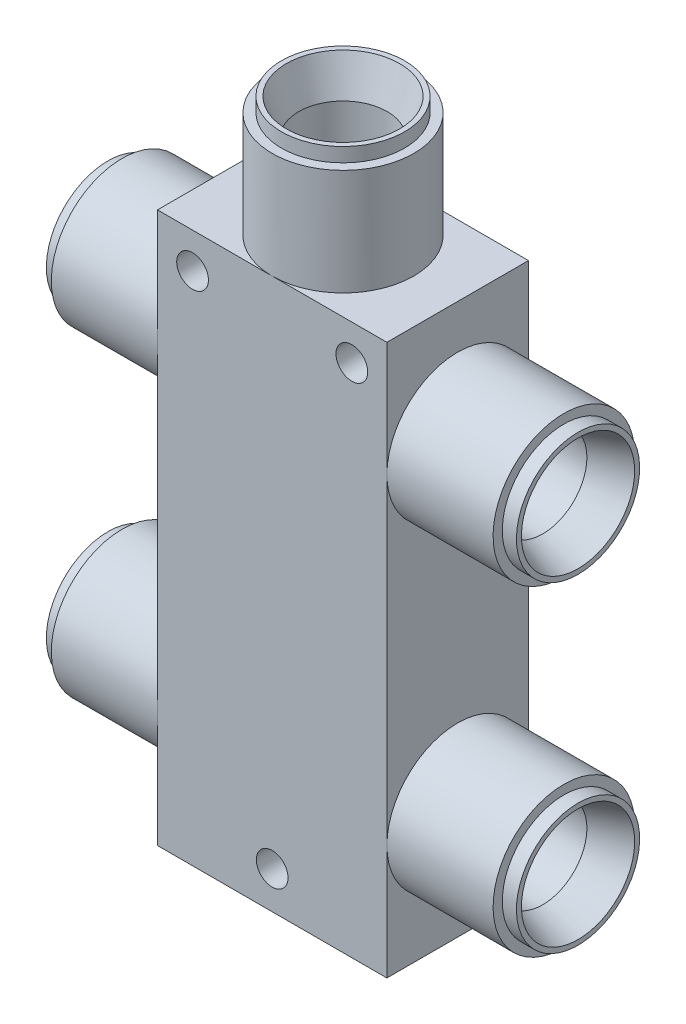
from build123d import *

# Parameters (mm, degrees)
EXTRUDE1_DEPTH        = 6.35
EXTRUDE1_DEPTH_BACK   = 6.35
SKETCH1_W             = 6.31825
SKETCH1_H             = 3.96875
SKETCH1_W_2           = 3.96875
SKETCH1_H_2           = 10.287
SKETCH1_W_3           = 10.287
SKETCH1_H_3           = 20.867366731
SKETCH1_7_W           = 3.96875
SKETCH1_7_H           = 39.091866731
SKETCH1_8_W           = 20.574
SKETCH1_8_H           = 3.96875
SKETCH3_R             = 3.96875
CUT_EXTRUDE1_DEPTH    = 69.155930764
F_4_40_TAPPED_HOLE1_D = 2.8448


with BuildPart() as part:
    # Sketch1 → Extrude1 (new, two sides: drawn at the far end of the back side and taken through both)
    with BuildSketch(Plane.XY.offset(-EXTRUDE1_DEPTH_BACK)):
        Polygon((6.31825, 14.25575), (6.31825, 35.123116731), (0, 35.123116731), (0, 32.741866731), (0, 16.637), (0, 14.25575), align=None)
        with Locations((3.159125, 37.107491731)):
            Rectangle(SKETCH1_W, SKETCH1_H)
        Polygon((6.31825, 39.091866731), (6.31825, 49.378866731), (3.937, 49.378866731), (0, 49.378866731), (0, 39.091866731), align=None)
        with Locations((8.302625, 44.235366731)):
            Rectangle(SKETCH1_W_2, SKETCH1_H_2)
        with Locations((15.4305, 44.235366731)):
            Rectangle(SKETCH1_W_3, SKETCH1_H_2)
        with Locations((15.4305, 37.107491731)):
            Rectangle(SKETCH1_W_3, SKETCH1_H)
        with Locations((8.302625, 37.107491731)):
            Rectangle(SKETCH1_W_2, SKETCH1_H)
        with Locations((8.302625, 24.689433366)):
            Rectangle(SKETCH1_W_2, SKETCH1_H_3)
        Polygon((20.574, 35.123116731), (10.287, 35.123116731), (10.287, 14.25575), (20.574, 14.25575), (20.574, 16.637), (20.574, 32.741866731), align=None)
        with Locations((15.4305, 12.271375)):
            Rectangle(SKETCH1_W_3, SKETCH1_H)
        with Locations((8.302625, 12.271375)):
            Rectangle(SKETCH1_W_2, SKETCH1_H)
        with Locations((3.159125, 12.271375)):
            Rectangle(SKETCH1_W, SKETCH1_H)
        Polygon((10.287, 10.287), (6.31825, 10.287), (0, 10.287), (0, 0), (20.574, 0), (20.574, 10.287), align=None)
    extrude(amount=EXTRUDE1_DEPTH + EXTRUDE1_DEPTH_BACK)

    # Sketch1_3 → Revolve1 (revolve)
    with BuildSketch(Plane.XY, mode=Mode.PRIVATE) as revolve1_sk:
        Polygon((3.937, 49.378866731), (6.31825, 49.378866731), (6.31825, 56.998866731), (5.207, 60.173866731), (4.7625, 60.173866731), (4.7625, 58.903866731), (3.937, 58.903866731), align=None)
    revolve(revolve1_sk.sketch.rotate(Axis((10.287, 0, 0), (0, 1, 0)), 270), axis=Axis((10.287, 0, 0), (0, 1, 0)))

    # Sketch1_4 → Revolve2 (revolve)
    with BuildSketch(Plane.XY):
        Polygon((0, 32.741866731), (0, 35.123116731), (-7.62, 35.123116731), (-10.795, 34.011866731), (-10.795, 33.567366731), (-9.525, 33.567366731), (-9.525, 32.741866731), align=None)
        Polygon((28.194, 35.123116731), (20.574, 35.123116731), (20.574, 32.741866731), (30.099, 32.741866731), (30.099, 33.567366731), (31.369, 33.567366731), (31.369, 34.011866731), align=None)
    revolve(axis=Axis((-17.78, 39.091866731, 0), (1, 0, 0)))

    # Sketch1_6 → Revolve4 (revolve)
    with BuildSketch(Plane.XY):
        Polygon((-7.62, 14.25575), (0, 14.25575), (0, 16.637), (-9.525, 16.637), (-9.525, 15.8115), (-10.795, 15.8115), (-10.795, 15.367), align=None)
        Polygon((20.574, 16.637), (20.574, 14.25575), (28.194, 14.25575), (31.369, 15.367), (31.369, 15.8115), (30.099, 15.8115), (30.099, 16.637), align=None)
    revolve(axis=Axis((38.354, 10.287, 0), (-1, 0, 0)))

    # Sketch1_7 → Cut-Revolve1 (revolve, cut)
    with BuildSketch(Plane.XY, mode=Mode.PRIVATE) as cut_revolve1_sk:
        with Locations((8.302625, 29.832933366)):
            Rectangle(SKETCH1_7_W, SKETCH1_7_H)
    revolve(cut_revolve1_sk.sketch.rotate(Axis((10.287, 0, 0), (0, 1, 0)), 270), axis=Axis((10.287, 0, 0), (0, 1, 0)), mode=Mode.SUBTRACT)

    # Sketch1_8 → Cut-Revolve2 (revolve, cut)
    with BuildSketch(Plane.XY):
        with Locations((10.287, 37.107491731)):
            Rectangle(SKETCH1_8_W, SKETCH1_8_H)
    revolve(axis=Axis((38.354, 39.091866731, 0), (-1, 0, 0)), mode=Mode.SUBTRACT)

    # Sketch3 → Cut-Extrude1 (cut, through all)
    with BuildSketch(Plane(origin=(20.574, 0, 0), x_dir=(0, 0, -1), z_dir=(1, 0, 0))):
        with Locations(Location((0, 10.287, 0), (0, 0, 90))):
            Circle(SKETCH3_R)
    extrude(amount=-CUT_EXTRUDE1_DEPTH, mode=Mode.SUBTRACT)

    # 4-40 Tapped Hole1 (through all)
    with Locations(Plane(origin=(17.43075, 46.203866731, 6.35), x_dir=(1, 0, 0), z_dir=(0, 0, 1))):
        with Locations((0, 0), (-7.14375, -42.8625), (-14.2875, 0)):
            Hole(F_4_40_TAPPED_HOLE1_D / 2)


solid = part.part
